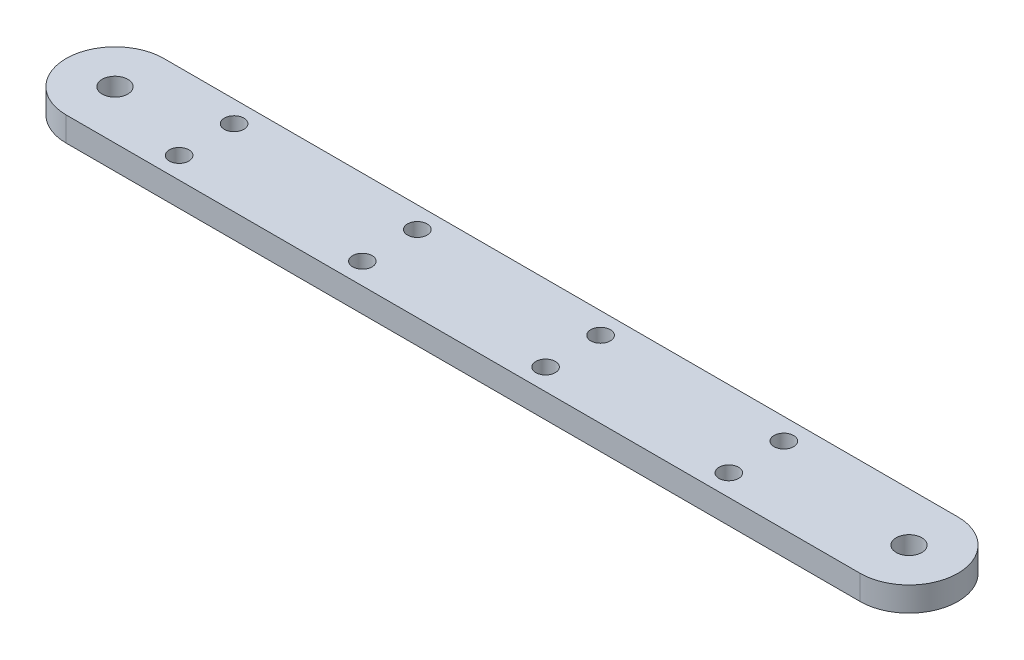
ISO-10303-21;
HEADER;
FILE_DESCRIPTION(('STEP AP214'),'2;1');
FILE_NAME('part.step','',(''),(''),'','','');
FILE_SCHEMA(('AUTOMOTIVE_DESIGN { 1 0 10303 214 1 1 1 1 }'));
ENDSEC;
DATA;
#1=APPLICATION_CONTEXT('core data for automotive mechanical design processes');
#2=APPLICATION_PROTOCOL_DEFINITION('international standard','automotive_design',2000,#1);
#3=PRODUCT_CONTEXT('',#1,'mechanical');
#4=PRODUCT('Part','Part','',(#3));
#5=PRODUCT_RELATED_PRODUCT_CATEGORY('part','',(#4));
#6=PRODUCT_DEFINITION_FORMATION('','',#4);
#7=PRODUCT_DEFINITION_CONTEXT('part definition',#1,'design');
#8=PRODUCT_DEFINITION('design','',#6,#7);
#9=PRODUCT_DEFINITION_SHAPE('','',#8);
#10=(LENGTH_UNIT() NAMED_UNIT(*) SI_UNIT(.MILLI.,.METRE.));
#11=(NAMED_UNIT(*) PLANE_ANGLE_UNIT() SI_UNIT($,.RADIAN.));
#12=(NAMED_UNIT(*) SI_UNIT($,.STERADIAN.) SOLID_ANGLE_UNIT());
#13=UNCERTAINTY_MEASURE_WITH_UNIT(LENGTH_MEASURE(1.E-05),#10,'distance_accuracy_value','');
#14=(GEOMETRIC_REPRESENTATION_CONTEXT(3) GLOBAL_UNCERTAINTY_ASSIGNED_CONTEXT((#13)) GLOBAL_UNIT_ASSIGNED_CONTEXT((#10,
#11,#12)) REPRESENTATION_CONTEXT('',''));
#15=CARTESIAN_POINT('',(0.,0.,0.));
#16=DIRECTION('',(0.,0.,1.));
#17=DIRECTION('',(1.,0.,0.));
#18=AXIS2_PLACEMENT_3D('',#15,#16,#17);
#19=CARTESIAN_POINT('',(-65.,4.,0.));
#20=DIRECTION('',(0.,1.,0.));
#21=DIRECTION('',(0.,0.,1.));
#22=AXIS2_PLACEMENT_3D('',#19,#20,#21);
#23=PLANE('',#22);
#24=CARTESIAN_POINT('',(-19.9999999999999,4.,4.49999999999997));
#25=DIRECTION('',(0.,1.,0.));
#26=DIRECTION('',(0.,0.,1.));
#27=AXIS2_PLACEMENT_3D('',#24,#25,#26);
#28=CIRCLE('',#27,1.6);
#29=CARTESIAN_POINT('',(-19.9999999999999,4.,6.09999999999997));
#30=VERTEX_POINT('',#29);
#31=EDGE_CURVE('E153',#30,#30,#28,.T.);
#32=ORIENTED_EDGE('',*,*,#31,.F.);
#33=EDGE_LOOP('',(#32));
#34=FACE_BOUND('',#33,.T.);
#35=CARTESIAN_POINT('',(40.,4.,-4.50000000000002));
#36=DIRECTION('',(0.,1.,0.));
#37=DIRECTION('',(0.,0.,1.));
#38=AXIS2_PLACEMENT_3D('',#35,#36,#37);
#39=CIRCLE('',#38,1.59999999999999);
#40=CARTESIAN_POINT('',(40.,4.,-2.90000000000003));
#41=VERTEX_POINT('',#40);
#42=EDGE_CURVE('E142',#41,#41,#39,.T.);
#43=ORIENTED_EDGE('',*,*,#42,.F.);
#44=EDGE_LOOP('',(#43));
#45=FACE_BOUND('',#44,.T.);
#46=CARTESIAN_POINT('',(9.99999999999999,4.,-4.50000000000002));
#47=DIRECTION('',(0.,1.,0.));
#48=DIRECTION('',(0.,0.,1.));
#49=AXIS2_PLACEMENT_3D('',#46,#47,#48);
#50=CIRCLE('',#49,1.6);
#51=CARTESIAN_POINT('',(9.99999999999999,4.,-2.90000000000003));
#52=VERTEX_POINT('',#51);
#53=EDGE_CURVE('E141',#52,#52,#50,.T.);
#54=ORIENTED_EDGE('',*,*,#53,.F.);
#55=EDGE_LOOP('',(#54));
#56=FACE_BOUND('',#55,.T.);
#57=CARTESIAN_POINT('',(-20.,4.,-4.50000000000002));
#58=DIRECTION('',(0.,1.,0.));
#59=DIRECTION('',(0.,0.,1.));
#60=AXIS2_PLACEMENT_3D('',#57,#58,#59);
#61=CIRCLE('',#60,1.6);
#62=CARTESIAN_POINT('',(-20.,4.,-2.90000000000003));
#63=VERTEX_POINT('',#62);
#64=EDGE_CURVE('E135',#63,#63,#61,.T.);
#65=ORIENTED_EDGE('',*,*,#64,.F.);
#66=EDGE_LOOP('',(#65));
#67=FACE_BOUND('',#66,.T.);
#68=CARTESIAN_POINT('',(10.0000000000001,4.,4.49999999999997));
#69=DIRECTION('',(0.,1.,0.));
#70=DIRECTION('',(0.,0.,1.));
#71=AXIS2_PLACEMENT_3D('',#68,#69,#70);
#72=CIRCLE('',#71,1.6);
#73=CARTESIAN_POINT('',(10.0000000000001,4.,6.09999999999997));
#74=VERTEX_POINT('',#73);
#75=EDGE_CURVE('E154',#74,#74,#72,.T.);
#76=ORIENTED_EDGE('',*,*,#75,.F.);
#77=EDGE_LOOP('',(#76));
#78=FACE_BOUND('',#77,.T.);
#79=CARTESIAN_POINT('',(40.0000000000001,4.,4.49999999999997));
#80=DIRECTION('',(0.,1.,0.));
#81=DIRECTION('',(0.,0.,1.));
#82=AXIS2_PLACEMENT_3D('',#79,#80,#81);
#83=CIRCLE('',#82,1.60000000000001);
#84=CARTESIAN_POINT('',(40.0000000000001,4.,6.09999999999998));
#85=VERTEX_POINT('',#84);
#86=EDGE_CURVE('E171',#85,#85,#83,.T.);
#87=ORIENTED_EDGE('',*,*,#86,.F.);
#88=EDGE_LOOP('',(#87));
#89=FACE_BOUND('',#88,.T.);
#90=CARTESIAN_POINT('',(-49.9999999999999,4.,4.49999999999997));
#91=DIRECTION('',(0.,1.,0.));
#92=DIRECTION('',(0.,0.,1.));
#93=AXIS2_PLACEMENT_3D('',#90,#91,#92);
#94=CIRCLE('',#93,1.6);
#95=CARTESIAN_POINT('',(-49.9999999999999,4.,6.09999999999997));
#96=VERTEX_POINT('',#95);
#97=EDGE_CURVE('E165',#96,#96,#94,.T.);
#98=ORIENTED_EDGE('',*,*,#97,.F.);
#99=EDGE_LOOP('',(#98));
#100=FACE_BOUND('',#99,.T.);
#101=CARTESIAN_POINT('',(-50.,4.,-4.50000000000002));
#102=DIRECTION('',(0.,1.,0.));
#103=DIRECTION('',(0.,0.,1.));
#104=AXIS2_PLACEMENT_3D('',#101,#102,#103);
#105=CIRCLE('',#104,1.6);
#106=CARTESIAN_POINT('',(-50.,4.,-2.90000000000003));
#107=VERTEX_POINT('',#106);
#108=EDGE_CURVE('E132',#107,#107,#105,.T.);
#109=ORIENTED_EDGE('',*,*,#108,.F.);
#110=EDGE_LOOP('',(#109));
#111=FACE_BOUND('',#110,.T.);
#112=CARTESIAN_POINT('',(-65.,4.,0.));
#113=DIRECTION('',(0.,1.,0.));
#114=DIRECTION('',(0.,0.,1.));
#115=AXIS2_PLACEMENT_3D('',#112,#113,#114);
#116=CIRCLE('',#115,2.1);
#117=CARTESIAN_POINT('',(-65.,4.,2.1));
#118=VERTEX_POINT('',#117);
#119=EDGE_CURVE('E108',#118,#118,#116,.T.);
#120=ORIENTED_EDGE('',*,*,#119,.F.);
#121=EDGE_LOOP('',(#120));
#122=FACE_BOUND('',#121,.T.);
#123=CARTESIAN_POINT('',(-65.,4.,0.));
#124=DIRECTION('',(0.,1.,0.));
#125=DIRECTION('',(0.,0.,1.));
#126=AXIS2_PLACEMENT_3D('',#123,#124,#125);
#127=CIRCLE('',#126,8.);
#128=CARTESIAN_POINT('',(-65.,4.,-8.));
#129=VERTEX_POINT('',#128);
#130=CARTESIAN_POINT('',(-65.,4.,8.));
#131=VERTEX_POINT('',#130);
#132=EDGE_CURVE('E93',#129,#131,#127,.T.);
#133=ORIENTED_EDGE('',*,*,#132,.T.);
#134=DIRECTION('',(1.,0.,0.));
#135=VECTOR('',#134,1.);
#136=CARTESIAN_POINT('',(-65.,4.,8.));
#137=LINE('',#136,#135);
#138=CARTESIAN_POINT('',(65.,4.,7.99999999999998));
#139=VERTEX_POINT('',#138);
#140=EDGE_CURVE('E88',#131,#139,#137,.T.);
#141=ORIENTED_EDGE('',*,*,#140,.T.);
#142=CARTESIAN_POINT('',(65.,4.,0.));
#143=DIRECTION('',(0.,1.,0.));
#144=DIRECTION('',(0.,0.,1.));
#145=AXIS2_PLACEMENT_3D('',#142,#143,#144);
#146=CIRCLE('',#145,8.);
#147=CARTESIAN_POINT('',(65.,4.,-8.00000000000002));
#148=VERTEX_POINT('',#147);
#149=EDGE_CURVE('E91',#139,#148,#146,.T.);
#150=ORIENTED_EDGE('',*,*,#149,.T.);
#151=DIRECTION('',(-1.,0.,0.));
#152=VECTOR('',#151,1.);
#153=CARTESIAN_POINT('',(-65.,4.,-8.));
#154=LINE('',#153,#152);
#155=EDGE_CURVE('E58',#148,#129,#154,.T.);
#156=ORIENTED_EDGE('',*,*,#155,.T.);
#157=EDGE_LOOP('',(#133,#141,#150,#156));
#158=FACE_BOUND('',#157,.T.);
#159=CARTESIAN_POINT('',(65.,4.,0.));
#160=DIRECTION('',(0.,1.,0.));
#161=DIRECTION('',(0.,0.,1.));
#162=AXIS2_PLACEMENT_3D('',#159,#160,#161);
#163=CIRCLE('',#162,2.1);
#164=CARTESIAN_POINT('',(65.,4.,2.09999999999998));
#165=VERTEX_POINT('',#164);
#166=EDGE_CURVE('E123',#165,#165,#163,.T.);
#167=ORIENTED_EDGE('',*,*,#166,.F.);
#168=EDGE_LOOP('',(#167));
#169=FACE_BOUND('',#168,.T.);
#170=ADVANCED_FACE('F41',(#34,#45,#56,#67,#78,#89,#100,#111,#122,#158,#169),#23,.T.);
#171=CARTESIAN_POINT('',(-65.,0.,0.));
#172=DIRECTION('',(0.,1.,0.));
#173=DIRECTION('',(0.,0.,1.));
#174=AXIS2_PLACEMENT_3D('',#171,#172,#173);
#175=PLANE('',#174);
#176=CARTESIAN_POINT('',(-19.9999999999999,0.,4.49999999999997));
#177=DIRECTION('',(0.,1.,0.));
#178=DIRECTION('',(0.,0.,1.));
#179=AXIS2_PLACEMENT_3D('',#176,#177,#178);
#180=CIRCLE('',#179,1.6);
#181=CARTESIAN_POINT('',(-19.9999999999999,0.,6.09999999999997));
#182=VERTEX_POINT('',#181);
#183=EDGE_CURVE('E150',#182,#182,#180,.T.);
#184=ORIENTED_EDGE('',*,*,#183,.T.);
#185=EDGE_LOOP('',(#184));
#186=FACE_BOUND('',#185,.T.);
#187=CARTESIAN_POINT('',(40.,0.,-4.50000000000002));
#188=DIRECTION('',(0.,1.,0.));
#189=DIRECTION('',(0.,0.,1.));
#190=AXIS2_PLACEMENT_3D('',#187,#188,#189);
#191=CIRCLE('',#190,1.59999999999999);
#192=CARTESIAN_POINT('',(40.,0.,-2.90000000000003));
#193=VERTEX_POINT('',#192);
#194=EDGE_CURVE('E157',#193,#193,#191,.T.);
#195=ORIENTED_EDGE('',*,*,#194,.T.);
#196=EDGE_LOOP('',(#195));
#197=FACE_BOUND('',#196,.T.);
#198=CARTESIAN_POINT('',(9.99999999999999,0.,-4.50000000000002));
#199=DIRECTION('',(0.,1.,0.));
#200=DIRECTION('',(0.,0.,1.));
#201=AXIS2_PLACEMENT_3D('',#198,#199,#200);
#202=CIRCLE('',#201,1.6);
#203=CARTESIAN_POINT('',(9.99999999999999,0.,-2.90000000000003));
#204=VERTEX_POINT('',#203);
#205=EDGE_CURVE('E138',#204,#204,#202,.T.);
#206=ORIENTED_EDGE('',*,*,#205,.T.);
#207=EDGE_LOOP('',(#206));
#208=FACE_BOUND('',#207,.T.);
#209=CARTESIAN_POINT('',(-20.,0.,-4.50000000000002));
#210=DIRECTION('',(0.,1.,0.));
#211=DIRECTION('',(0.,0.,1.));
#212=AXIS2_PLACEMENT_3D('',#209,#210,#211);
#213=CIRCLE('',#212,1.6);
#214=CARTESIAN_POINT('',(-20.,0.,-2.90000000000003));
#215=VERTEX_POINT('',#214);
#216=EDGE_CURVE('E145',#215,#215,#213,.T.);
#217=ORIENTED_EDGE('',*,*,#216,.T.);
#218=EDGE_LOOP('',(#217));
#219=FACE_BOUND('',#218,.T.);
#220=CARTESIAN_POINT('',(10.0000000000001,0.,4.49999999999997));
#221=DIRECTION('',(0.,1.,0.));
#222=DIRECTION('',(0.,0.,1.));
#223=AXIS2_PLACEMENT_3D('',#220,#221,#222);
#224=CIRCLE('',#223,1.6);
#225=CARTESIAN_POINT('',(10.0000000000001,0.,6.09999999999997));
#226=VERTEX_POINT('',#225);
#227=EDGE_CURVE('E174',#226,#226,#224,.T.);
#228=ORIENTED_EDGE('',*,*,#227,.T.);
#229=EDGE_LOOP('',(#228));
#230=FACE_BOUND('',#229,.T.);
#231=CARTESIAN_POINT('',(40.0000000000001,0.,4.49999999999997));
#232=DIRECTION('',(0.,1.,0.));
#233=DIRECTION('',(0.,0.,1.));
#234=AXIS2_PLACEMENT_3D('',#231,#232,#233);
#235=CIRCLE('',#234,1.60000000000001);
#236=CARTESIAN_POINT('',(40.0000000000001,0.,6.09999999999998));
#237=VERTEX_POINT('',#236);
#238=EDGE_CURVE('E168',#237,#237,#235,.T.);
#239=ORIENTED_EDGE('',*,*,#238,.T.);
#240=EDGE_LOOP('',(#239));
#241=FACE_BOUND('',#240,.T.);
#242=CARTESIAN_POINT('',(-49.9999999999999,0.,4.49999999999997));
#243=DIRECTION('',(0.,1.,0.));
#244=DIRECTION('',(0.,0.,1.));
#245=AXIS2_PLACEMENT_3D('',#242,#243,#244);
#246=CIRCLE('',#245,1.6);
#247=CARTESIAN_POINT('',(-49.9999999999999,0.,6.09999999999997));
#248=VERTEX_POINT('',#247);
#249=EDGE_CURVE('E162',#248,#248,#246,.T.);
#250=ORIENTED_EDGE('',*,*,#249,.T.);
#251=EDGE_LOOP('',(#250));
#252=FACE_BOUND('',#251,.T.);
#253=CARTESIAN_POINT('',(-50.,0.,-4.50000000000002));
#254=DIRECTION('',(0.,1.,0.));
#255=DIRECTION('',(0.,0.,1.));
#256=AXIS2_PLACEMENT_3D('',#253,#254,#255);
#257=CIRCLE('',#256,1.6);
#258=CARTESIAN_POINT('',(-50.,0.,-2.90000000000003));
#259=VERTEX_POINT('',#258);
#260=EDGE_CURVE('E129',#259,#259,#257,.T.);
#261=ORIENTED_EDGE('',*,*,#260,.T.);
#262=EDGE_LOOP('',(#261));
#263=FACE_BOUND('',#262,.T.);
#264=CARTESIAN_POINT('',(-65.,0.,0.));
#265=DIRECTION('',(0.,1.,0.));
#266=DIRECTION('',(0.,0.,1.));
#267=AXIS2_PLACEMENT_3D('',#264,#265,#266);
#268=CIRCLE('',#267,8.);
#269=CARTESIAN_POINT('',(-65.,0.,-8.));
#270=VERTEX_POINT('',#269);
#271=CARTESIAN_POINT('',(-65.,0.,8.));
#272=VERTEX_POINT('',#271);
#273=EDGE_CURVE('E105',#270,#272,#268,.T.);
#274=ORIENTED_EDGE('',*,*,#273,.F.);
#275=DIRECTION('',(-1.,0.,0.));
#276=VECTOR('',#275,1.);
#277=CARTESIAN_POINT('',(-65.,0.,-8.));
#278=LINE('',#277,#276);
#279=CARTESIAN_POINT('',(65.,0.,-8.00000000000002));
#280=VERTEX_POINT('',#279);
#281=EDGE_CURVE('E81',#280,#270,#278,.T.);
#282=ORIENTED_EDGE('',*,*,#281,.F.);
#283=CARTESIAN_POINT('',(65.,0.,0.));
#284=DIRECTION('',(0.,1.,0.));
#285=DIRECTION('',(0.,0.,1.));
#286=AXIS2_PLACEMENT_3D('',#283,#284,#285);
#287=CIRCLE('',#286,8.);
#288=CARTESIAN_POINT('',(65.,0.,7.99999999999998));
#289=VERTEX_POINT('',#288);
#290=EDGE_CURVE('E75',#289,#280,#287,.T.);
#291=ORIENTED_EDGE('',*,*,#290,.F.);
#292=DIRECTION('',(1.,0.,0.));
#293=VECTOR('',#292,1.);
#294=CARTESIAN_POINT('',(-65.,0.,8.));
#295=LINE('',#294,#293);
#296=EDGE_CURVE('E97',#272,#289,#295,.T.);
#297=ORIENTED_EDGE('',*,*,#296,.F.);
#298=EDGE_LOOP('',(#274,#282,#291,#297));
#299=FACE_BOUND('',#298,.T.);
#300=CARTESIAN_POINT('',(-65.,0.,0.));
#301=DIRECTION('',(0.,1.,0.));
#302=DIRECTION('',(0.,0.,1.));
#303=AXIS2_PLACEMENT_3D('',#300,#301,#302);
#304=CIRCLE('',#303,2.1);
#305=CARTESIAN_POINT('',(-65.,0.,2.1));
#306=VERTEX_POINT('',#305);
#307=EDGE_CURVE('E120',#306,#306,#304,.T.);
#308=ORIENTED_EDGE('',*,*,#307,.T.);
#309=EDGE_LOOP('',(#308));
#310=FACE_BOUND('',#309,.T.);
#311=CARTESIAN_POINT('',(65.,0.,0.));
#312=DIRECTION('',(0.,1.,0.));
#313=DIRECTION('',(0.,0.,1.));
#314=AXIS2_PLACEMENT_3D('',#311,#312,#313);
#315=CIRCLE('',#314,2.1);
#316=CARTESIAN_POINT('',(65.,0.,2.09999999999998));
#317=VERTEX_POINT('',#316);
#318=EDGE_CURVE('E126',#317,#317,#315,.T.);
#319=ORIENTED_EDGE('',*,*,#318,.T.);
#320=EDGE_LOOP('',(#319));
#321=FACE_BOUND('',#320,.T.);
#322=ADVANCED_FACE('F116',(#186,#197,#208,#219,#230,#241,#252,#263,#299,#310,#321),#175,.F.);
#323=CARTESIAN_POINT('',(-65.,4.,0.));
#324=DIRECTION('',(0.,-1.,0.));
#325=DIRECTION('',(0.,0.,-1.));
#326=AXIS2_PLACEMENT_3D('',#323,#324,#325);
#327=CYLINDRICAL_SURFACE('',#326,8.);
#328=ORIENTED_EDGE('',*,*,#273,.T.);
#329=DIRECTION('',(0.,-1.,0.));
#330=VECTOR('',#329,1.);
#331=CARTESIAN_POINT('',(-65.,4.,8.));
#332=LINE('',#331,#330);
#333=EDGE_CURVE('E11',#131,#272,#332,.T.);
#334=ORIENTED_EDGE('',*,*,#333,.F.);
#335=ORIENTED_EDGE('',*,*,#132,.F.);
#336=DIRECTION('',(0.,-1.,0.));
#337=VECTOR('',#336,1.);
#338=CARTESIAN_POINT('',(-65.,4.,-8.));
#339=LINE('',#338,#337);
#340=EDGE_CURVE('E101',#129,#270,#339,.T.);
#341=ORIENTED_EDGE('',*,*,#340,.T.);
#342=EDGE_LOOP('',(#328,#334,#335,#341));
#343=FACE_BOUND('',#342,.T.);
#344=ADVANCED_FACE('F43',(#343),#327,.T.);
#345=CARTESIAN_POINT('',(-65.,4.,8.));
#346=DIRECTION('',(0.,0.,-1.));
#347=DIRECTION('',(-1.,0.,0.));
#348=AXIS2_PLACEMENT_3D('',#345,#346,#347);
#349=PLANE('',#348);
#350=ORIENTED_EDGE('',*,*,#296,.T.);
#351=DIRECTION('',(0.,-1.,0.));
#352=VECTOR('',#351,1.);
#353=CARTESIAN_POINT('',(65.,4.,7.99999999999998));
#354=LINE('',#353,#352);
#355=EDGE_CURVE('E50',#139,#289,#354,.T.);
#356=ORIENTED_EDGE('',*,*,#355,.F.);
#357=ORIENTED_EDGE('',*,*,#140,.F.);
#358=ORIENTED_EDGE('',*,*,#333,.T.);
#359=EDGE_LOOP('',(#350,#356,#357,#358));
#360=FACE_BOUND('',#359,.T.);
#361=ADVANCED_FACE('F96',(#360),#349,.F.);
#362=CARTESIAN_POINT('',(65.,4.,0.));
#363=DIRECTION('',(0.,-1.,0.));
#364=DIRECTION('',(0.,0.,-1.));
#365=AXIS2_PLACEMENT_3D('',#362,#363,#364);
#366=CYLINDRICAL_SURFACE('',#365,8.);
#367=ORIENTED_EDGE('',*,*,#290,.T.);
#368=DIRECTION('',(0.,-1.,0.));
#369=VECTOR('',#368,1.);
#370=CARTESIAN_POINT('',(65.,4.,-8.00000000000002));
#371=LINE('',#370,#369);
#372=EDGE_CURVE('E98',#148,#280,#371,.T.);
#373=ORIENTED_EDGE('',*,*,#372,.F.);
#374=ORIENTED_EDGE('',*,*,#149,.F.);
#375=ORIENTED_EDGE('',*,*,#355,.T.);
#376=EDGE_LOOP('',(#367,#373,#374,#375));
#377=FACE_BOUND('',#376,.T.);
#378=ADVANCED_FACE('F99',(#377),#366,.T.);
#379=CARTESIAN_POINT('',(-65.,4.,-8.));
#380=DIRECTION('',(0.,0.,1.));
#381=DIRECTION('',(1.,0.,0.));
#382=AXIS2_PLACEMENT_3D('',#379,#380,#381);
#383=PLANE('',#382);
#384=ORIENTED_EDGE('',*,*,#281,.T.);
#385=ORIENTED_EDGE('',*,*,#340,.F.);
#386=ORIENTED_EDGE('',*,*,#155,.F.);
#387=ORIENTED_EDGE('',*,*,#372,.T.);
#388=EDGE_LOOP('',(#384,#385,#386,#387));
#389=FACE_BOUND('',#388,.T.);
#390=ADVANCED_FACE('F113',(#389),#383,.F.);
#391=CARTESIAN_POINT('',(-65.,4.,0.));
#392=DIRECTION('',(0.,-1.,0.));
#393=DIRECTION('',(0.,0.,-1.));
#394=AXIS2_PLACEMENT_3D('',#391,#392,#393);
#395=CYLINDRICAL_SURFACE('',#394,2.1);
#396=ORIENTED_EDGE('',*,*,#119,.T.);
#397=EDGE_LOOP('',(#396));
#398=FACE_BOUND('',#397,.T.);
#399=ORIENTED_EDGE('',*,*,#307,.F.);
#400=EDGE_LOOP('',(#399));
#401=FACE_BOUND('',#400,.T.);
#402=ADVANCED_FACE('F194',(#398,#401),#395,.F.);
#403=CARTESIAN_POINT('',(65.,4.,0.));
#404=DIRECTION('',(0.,-1.,0.));
#405=DIRECTION('',(0.,0.,-1.));
#406=AXIS2_PLACEMENT_3D('',#403,#404,#405);
#407=CYLINDRICAL_SURFACE('',#406,2.1);
#408=ORIENTED_EDGE('',*,*,#166,.T.);
#409=EDGE_LOOP('',(#408));
#410=FACE_BOUND('',#409,.T.);
#411=ORIENTED_EDGE('',*,*,#318,.F.);
#412=EDGE_LOOP('',(#411));
#413=FACE_BOUND('',#412,.T.);
#414=ADVANCED_FACE('F197',(#410,#413),#407,.F.);
#415=CARTESIAN_POINT('',(-50.,0.,-4.50000000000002));
#416=DIRECTION('',(0.,1.,0.));
#417=DIRECTION('',(0.,0.,1.));
#418=AXIS2_PLACEMENT_3D('',#415,#416,#417);
#419=CYLINDRICAL_SURFACE('',#418,1.6);
#420=ORIENTED_EDGE('',*,*,#260,.F.);
#421=EDGE_LOOP('',(#420));
#422=FACE_BOUND('',#421,.T.);
#423=ORIENTED_EDGE('',*,*,#108,.T.);
#424=EDGE_LOOP('',(#423));
#425=FACE_BOUND('',#424,.T.);
#426=ADVANCED_FACE('F207',(#422,#425),#419,.F.);
#427=CARTESIAN_POINT('',(-49.9999999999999,0.,4.49999999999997));
#428=DIRECTION('',(0.,1.,0.));
#429=DIRECTION('',(0.,0.,1.));
#430=AXIS2_PLACEMENT_3D('',#427,#428,#429);
#431=CYLINDRICAL_SURFACE('',#430,1.6);
#432=ORIENTED_EDGE('',*,*,#249,.F.);
#433=EDGE_LOOP('',(#432));
#434=FACE_BOUND('',#433,.T.);
#435=ORIENTED_EDGE('',*,*,#97,.T.);
#436=EDGE_LOOP('',(#435));
#437=FACE_BOUND('',#436,.T.);
#438=ADVANCED_FACE('F213',(#434,#437),#431,.F.);
#439=CARTESIAN_POINT('',(40.0000000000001,0.,4.49999999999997));
#440=DIRECTION('',(0.,1.,0.));
#441=DIRECTION('',(0.,0.,1.));
#442=AXIS2_PLACEMENT_3D('',#439,#440,#441);
#443=CYLINDRICAL_SURFACE('',#442,1.60000000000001);
#444=ORIENTED_EDGE('',*,*,#238,.F.);
#445=EDGE_LOOP('',(#444));
#446=FACE_BOUND('',#445,.T.);
#447=ORIENTED_EDGE('',*,*,#86,.T.);
#448=EDGE_LOOP('',(#447));
#449=FACE_BOUND('',#448,.T.);
#450=ADVANCED_FACE('F274',(#446,#449),#443,.F.);
#451=CARTESIAN_POINT('',(10.0000000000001,0.,4.49999999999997));
#452=DIRECTION('',(0.,1.,0.));
#453=DIRECTION('',(0.,0.,1.));
#454=AXIS2_PLACEMENT_3D('',#451,#452,#453);
#455=CYLINDRICAL_SURFACE('',#454,1.6);
#456=ORIENTED_EDGE('',*,*,#227,.F.);
#457=EDGE_LOOP('',(#456));
#458=FACE_BOUND('',#457,.T.);
#459=ORIENTED_EDGE('',*,*,#75,.T.);
#460=EDGE_LOOP('',(#459));
#461=FACE_BOUND('',#460,.T.);
#462=ADVANCED_FACE('F180',(#458,#461),#455,.F.);
#463=CARTESIAN_POINT('',(-20.,0.,-4.50000000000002));
#464=DIRECTION('',(0.,1.,0.));
#465=DIRECTION('',(0.,0.,1.));
#466=AXIS2_PLACEMENT_3D('',#463,#464,#465);
#467=CYLINDRICAL_SURFACE('',#466,1.6);
#468=ORIENTED_EDGE('',*,*,#216,.F.);
#469=EDGE_LOOP('',(#468));
#470=FACE_BOUND('',#469,.T.);
#471=ORIENTED_EDGE('',*,*,#64,.T.);
#472=EDGE_LOOP('',(#471));
#473=FACE_BOUND('',#472,.T.);
#474=ADVANCED_FACE('F293',(#470,#473),#467,.F.);
#475=CARTESIAN_POINT('',(9.99999999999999,0.,-4.50000000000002));
#476=DIRECTION('',(0.,1.,0.));
#477=DIRECTION('',(0.,0.,1.));
#478=AXIS2_PLACEMENT_3D('',#475,#476,#477);
#479=CYLINDRICAL_SURFACE('',#478,1.6);
#480=ORIENTED_EDGE('',*,*,#205,.F.);
#481=EDGE_LOOP('',(#480));
#482=FACE_BOUND('',#481,.T.);
#483=ORIENTED_EDGE('',*,*,#53,.T.);
#484=EDGE_LOOP('',(#483));
#485=FACE_BOUND('',#484,.T.);
#486=ADVANCED_FACE('F303',(#482,#485),#479,.F.);
#487=CARTESIAN_POINT('',(40.,0.,-4.50000000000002));
#488=DIRECTION('',(0.,1.,0.));
#489=DIRECTION('',(0.,0.,1.));
#490=AXIS2_PLACEMENT_3D('',#487,#488,#489);
#491=CYLINDRICAL_SURFACE('',#490,1.59999999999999);
#492=ORIENTED_EDGE('',*,*,#194,.F.);
#493=EDGE_LOOP('',(#492));
#494=FACE_BOUND('',#493,.T.);
#495=ORIENTED_EDGE('',*,*,#42,.T.);
#496=EDGE_LOOP('',(#495));
#497=FACE_BOUND('',#496,.T.);
#498=ADVANCED_FACE('F313',(#494,#497),#491,.F.);
#499=CARTESIAN_POINT('',(-19.9999999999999,0.,4.49999999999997));
#500=DIRECTION('',(0.,1.,0.));
#501=DIRECTION('',(0.,0.,1.));
#502=AXIS2_PLACEMENT_3D('',#499,#500,#501);
#503=CYLINDRICAL_SURFACE('',#502,1.6);
#504=ORIENTED_EDGE('',*,*,#183,.F.);
#505=EDGE_LOOP('',(#504));
#506=FACE_BOUND('',#505,.T.);
#507=ORIENTED_EDGE('',*,*,#31,.T.);
#508=EDGE_LOOP('',(#507));
#509=FACE_BOUND('',#508,.T.);
#510=ADVANCED_FACE('F322',(#506,#509),#503,.F.);
#511=CLOSED_SHELL('',(#170,#322,#344,#361,#378,#390,#402,#414,#426,#438,#450,#462,#474,#486,
#498,#510));
#512=MANIFOLD_SOLID_BREP('B2',#511);
#513=ADVANCED_BREP_SHAPE_REPRESENTATION('',(#18,#512),#14);
#514=SHAPE_DEFINITION_REPRESENTATION(#9,#513);
ENDSEC;
END-ISO-10303-21;
